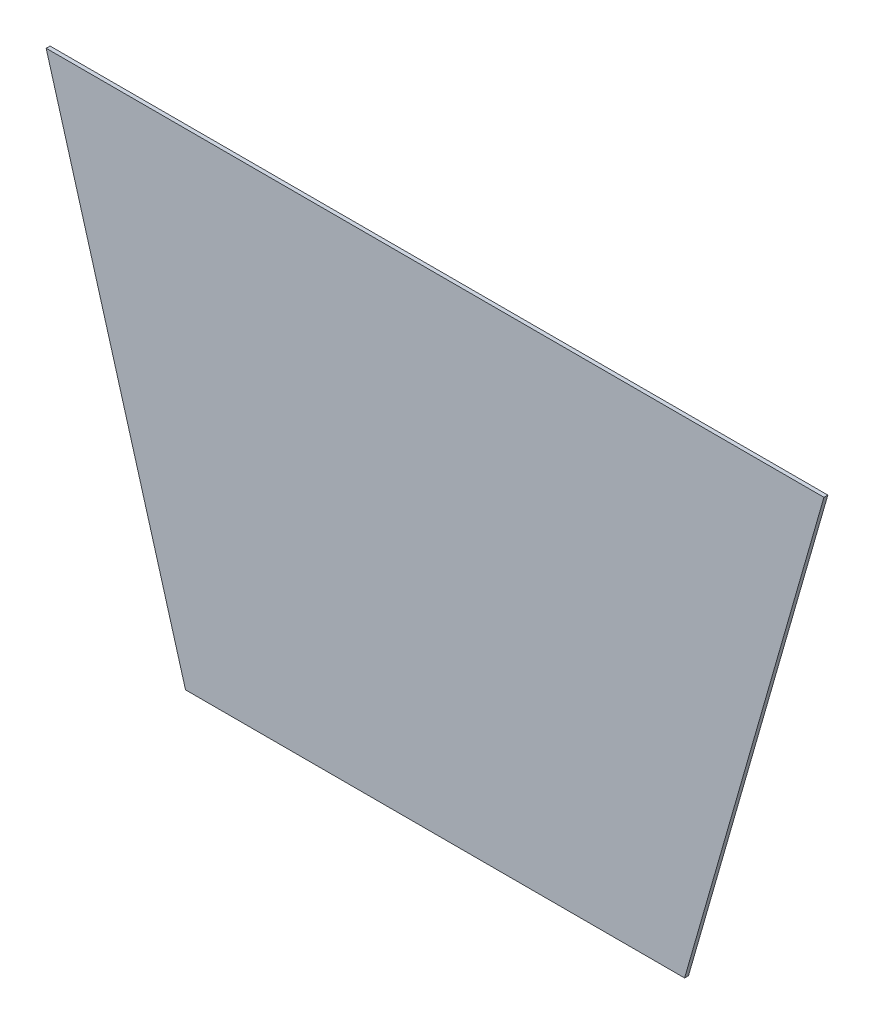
from build123d import *

# Parameters (mm, degrees)
EXTRUDE_1_DEPTH = 3


with BuildPart() as part:
    # Sketch 1 → Extrude 1 (new body)
    with BuildSketch(Plane.XY):
        Polygon((-192.5, 0), (192.5, 0), (300, 374.891651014), (-300, 374.891651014), align=None)
    extrude(amount=EXTRUDE_1_DEPTH)


solid = part.part
